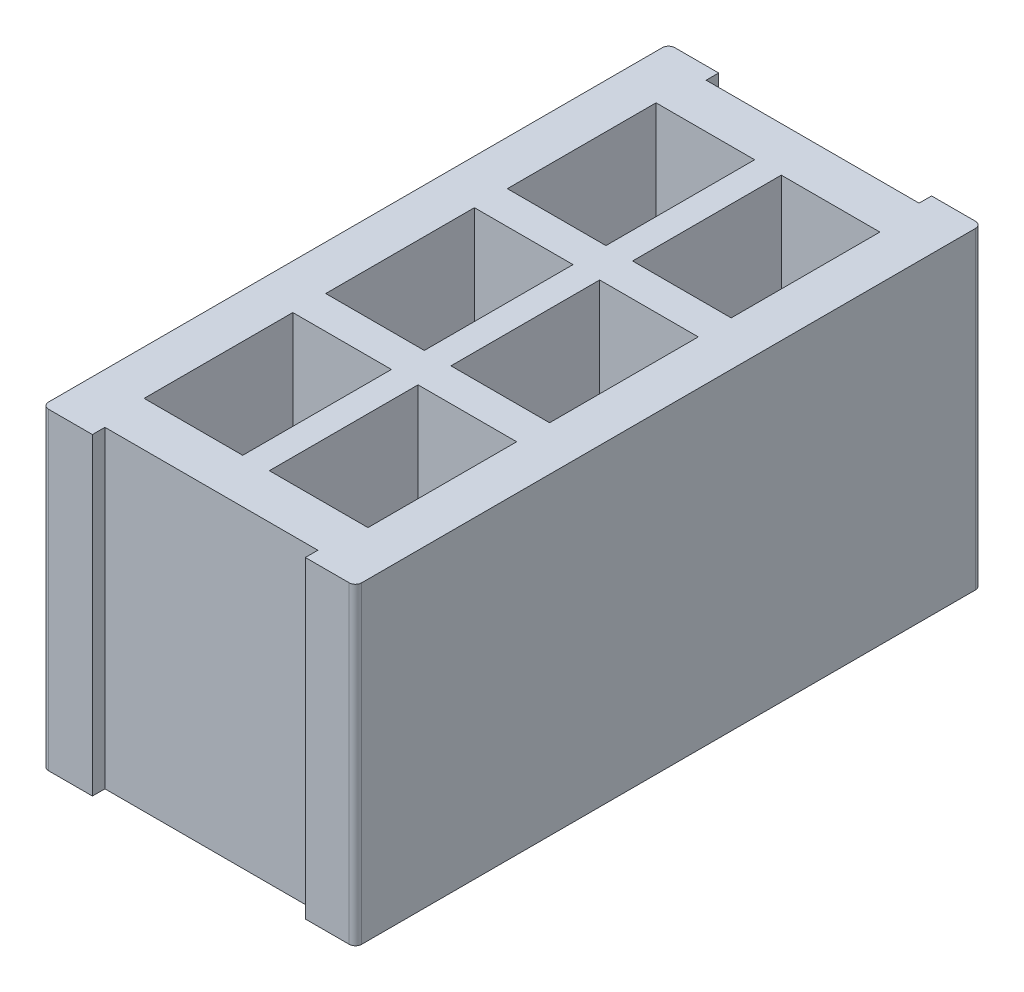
ISO-10303-21;
HEADER;
FILE_DESCRIPTION(('STEP AP214'),'2;1');
FILE_NAME('part.step','',(''),(''),'','','');
FILE_SCHEMA(('AUTOMOTIVE_DESIGN { 1 0 10303 214 1 1 1 1 }'));
ENDSEC;
DATA;
#1=APPLICATION_CONTEXT('core data for automotive mechanical design processes');
#2=APPLICATION_PROTOCOL_DEFINITION('international standard','automotive_design',2000,#1);
#3=PRODUCT_CONTEXT('',#1,'mechanical');
#4=PRODUCT('Part','Part','',(#3));
#5=PRODUCT_RELATED_PRODUCT_CATEGORY('part','',(#4));
#6=PRODUCT_DEFINITION_FORMATION('','',#4);
#7=PRODUCT_DEFINITION_CONTEXT('part definition',#1,'design');
#8=PRODUCT_DEFINITION('design','',#6,#7);
#9=PRODUCT_DEFINITION_SHAPE('','',#8);
#10=(LENGTH_UNIT() NAMED_UNIT(*) SI_UNIT(.MILLI.,.METRE.));
#11=(NAMED_UNIT(*) PLANE_ANGLE_UNIT() SI_UNIT($,.RADIAN.));
#12=(NAMED_UNIT(*) SI_UNIT($,.STERADIAN.) SOLID_ANGLE_UNIT());
#13=UNCERTAINTY_MEASURE_WITH_UNIT(LENGTH_MEASURE(1.E-05),#10,'distance_accuracy_value','');
#14=(GEOMETRIC_REPRESENTATION_CONTEXT(3) GLOBAL_UNCERTAINTY_ASSIGNED_CONTEXT((#13)) GLOBAL_UNIT_ASSIGNED_CONTEXT((#10,
#11,#12)) REPRESENTATION_CONTEXT('',''));
#15=CARTESIAN_POINT('',(0.,0.,0.));
#16=DIRECTION('',(0.,0.,1.));
#17=DIRECTION('',(1.,0.,0.));
#18=AXIS2_PLACEMENT_3D('',#15,#16,#17);
#19=CARTESIAN_POINT('',(4.,25.,-49.));
#20=DIRECTION('',(-1.,0.,0.));
#21=DIRECTION('',(0.,0.,1.));
#22=AXIS2_PLACEMENT_3D('',#19,#20,#21);
#23=PLANE('',#22);
#24=DIRECTION('',(0.,0.,-1.));
#25=VECTOR('',#24,1.);
#26=CARTESIAN_POINT('',(4.,0.,-49.));
#27=LINE('',#26,#25);
#28=CARTESIAN_POINT('',(4.,0.,-49.));
#29=VERTEX_POINT('',#28);
#30=CARTESIAN_POINT('',(4.,0.,-50.));
#31=VERTEX_POINT('',#30);
#32=EDGE_CURVE('E460',#29,#31,#27,.T.);
#33=ORIENTED_EDGE('',*,*,#32,.T.);
#34=DIRECTION('',(0.,-1.,0.));
#35=VECTOR('',#34,1.);
#36=CARTESIAN_POINT('',(4.,25.,-50.));
#37=LINE('',#36,#35);
#38=CARTESIAN_POINT('',(4.,25.,-50.));
#39=VERTEX_POINT('',#38);
#40=EDGE_CURVE('E11',#39,#31,#37,.T.);
#41=ORIENTED_EDGE('',*,*,#40,.F.);
#42=DIRECTION('',(0.,0.,-1.));
#43=VECTOR('',#42,1.);
#44=CARTESIAN_POINT('',(4.,25.,-49.));
#45=LINE('',#44,#43);
#46=CARTESIAN_POINT('',(4.,25.,-49.));
#47=VERTEX_POINT('',#46);
#48=EDGE_CURVE('E511',#47,#39,#45,.T.);
#49=ORIENTED_EDGE('',*,*,#48,.F.);
#50=DIRECTION('',(0.,-1.,0.));
#51=VECTOR('',#50,1.);
#52=CARTESIAN_POINT('',(4.,25.,-49.));
#53=LINE('',#52,#51);
#54=EDGE_CURVE('E544',#47,#29,#53,.T.);
#55=ORIENTED_EDGE('',*,*,#54,.T.);
#56=EDGE_LOOP('',(#33,#41,#49,#55));
#57=FACE_BOUND('',#56,.T.);
#58=ADVANCED_FACE('F26',(#57),#23,.F.);
#59=CARTESIAN_POINT('',(0.500000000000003,25.,-50.));
#60=DIRECTION('',(0.,0.,1.));
#61=DIRECTION('',(1.,0.,0.));
#62=AXIS2_PLACEMENT_3D('',#59,#60,#61);
#63=PLANE('',#62);
#64=DIRECTION('',(-1.,0.,0.));
#65=VECTOR('',#64,1.);
#66=CARTESIAN_POINT('',(0.500000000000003,0.,-50.));
#67=LINE('',#66,#65);
#68=CARTESIAN_POINT('',(0.500000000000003,0.,-50.));
#69=VERTEX_POINT('',#68);
#70=EDGE_CURVE('E481',#31,#69,#67,.T.);
#71=ORIENTED_EDGE('',*,*,#70,.T.);
#72=DIRECTION('',(0.,-1.,0.));
#73=VECTOR('',#72,1.);
#74=CARTESIAN_POINT('',(0.500000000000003,25.,-50.));
#75=LINE('',#74,#73);
#76=CARTESIAN_POINT('',(0.500000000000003,25.,-50.));
#77=VERTEX_POINT('',#76);
#78=EDGE_CURVE('E33',#77,#69,#75,.T.);
#79=ORIENTED_EDGE('',*,*,#78,.F.);
#80=DIRECTION('',(-1.,0.,0.));
#81=VECTOR('',#80,1.);
#82=CARTESIAN_POINT('',(0.500000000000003,25.,-50.));
#83=LINE('',#82,#81);
#84=EDGE_CURVE('E514',#39,#77,#83,.T.);
#85=ORIENTED_EDGE('',*,*,#84,.F.);
#86=ORIENTED_EDGE('',*,*,#40,.T.);
#87=EDGE_LOOP('',(#71,#79,#85,#86));
#88=FACE_BOUND('',#87,.T.);
#89=ADVANCED_FACE('F612',(#88),#63,.F.);
#90=CARTESIAN_POINT('',(0.5,25.,-49.5));
#91=DIRECTION('',(0.,-1.,0.));
#92=DIRECTION('',(0.,0.,-1.));
#93=AXIS2_PLACEMENT_3D('',#90,#91,#92);
#94=CYLINDRICAL_SURFACE('',#93,0.5);
#95=CARTESIAN_POINT('',(0.5,0.,-49.5));
#96=DIRECTION('',(0.,1.,0.));
#97=DIRECTION('',(0.,0.,1.));
#98=AXIS2_PLACEMENT_3D('',#95,#96,#97);
#99=CIRCLE('',#98,0.5);
#100=CARTESIAN_POINT('',(0.,0.,-49.5));
#101=VERTEX_POINT('',#100);
#102=EDGE_CURVE('E483',#69,#101,#99,.T.);
#103=ORIENTED_EDGE('',*,*,#102,.T.);
#104=DIRECTION('',(0.,-1.,0.));
#105=VECTOR('',#104,1.);
#106=CARTESIAN_POINT('',(0.,25.,-49.5));
#107=LINE('',#106,#105);
#108=CARTESIAN_POINT('',(0.,25.,-49.5));
#109=VERTEX_POINT('',#108);
#110=EDGE_CURVE('E583',#109,#101,#107,.T.);
#111=ORIENTED_EDGE('',*,*,#110,.F.);
#112=CARTESIAN_POINT('',(0.5,25.,-49.5));
#113=DIRECTION('',(0.,1.,0.));
#114=DIRECTION('',(0.,0.,1.));
#115=AXIS2_PLACEMENT_3D('',#112,#113,#114);
#116=CIRCLE('',#115,0.5);
#117=EDGE_CURVE('E516',#77,#109,#116,.T.);
#118=ORIENTED_EDGE('',*,*,#117,.F.);
#119=ORIENTED_EDGE('',*,*,#78,.T.);
#120=EDGE_LOOP('',(#103,#111,#118,#119));
#121=FACE_BOUND('',#120,.T.);
#122=ADVANCED_FACE('F590',(#121),#94,.T.);
#123=CARTESIAN_POINT('',(0.,25.,-49.5));
#124=DIRECTION('',(1.,0.,0.));
#125=DIRECTION('',(0.,0.,-1.));
#126=AXIS2_PLACEMENT_3D('',#123,#124,#125);
#127=PLANE('',#126);
#128=DIRECTION('',(0.,0.,1.));
#129=VECTOR('',#128,1.);
#130=CARTESIAN_POINT('',(0.,0.,-49.5));
#131=LINE('',#130,#129);
#132=CARTESIAN_POINT('',(0.,0.,-0.500000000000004));
#133=VERTEX_POINT('',#132);
#134=EDGE_CURVE('E485',#101,#133,#131,.T.);
#135=ORIENTED_EDGE('',*,*,#134,.T.);
#136=DIRECTION('',(0.,-1.,0.));
#137=VECTOR('',#136,1.);
#138=CARTESIAN_POINT('',(0.,25.,-0.500000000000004));
#139=LINE('',#138,#137);
#140=CARTESIAN_POINT('',(0.,25.,-0.500000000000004));
#141=VERTEX_POINT('',#140);
#142=EDGE_CURVE('E580',#141,#133,#139,.T.);
#143=ORIENTED_EDGE('',*,*,#142,.F.);
#144=DIRECTION('',(0.,0.,1.));
#145=VECTOR('',#144,1.);
#146=CARTESIAN_POINT('',(0.,25.,-49.5));
#147=LINE('',#146,#145);
#148=EDGE_CURVE('E518',#109,#141,#147,.T.);
#149=ORIENTED_EDGE('',*,*,#148,.F.);
#150=ORIENTED_EDGE('',*,*,#110,.T.);
#151=EDGE_LOOP('',(#135,#143,#149,#150));
#152=FACE_BOUND('',#151,.T.);
#153=ADVANCED_FACE('F600',(#152),#127,.F.);
#154=CARTESIAN_POINT('',(0.5,25.,-0.5));
#155=DIRECTION('',(0.,-1.,0.));
#156=DIRECTION('',(0.,0.,-1.));
#157=AXIS2_PLACEMENT_3D('',#154,#155,#156);
#158=CYLINDRICAL_SURFACE('',#157,0.5);
#159=CARTESIAN_POINT('',(0.5,0.,-0.5));
#160=DIRECTION('',(0.,1.,0.));
#161=DIRECTION('',(0.,0.,1.));
#162=AXIS2_PLACEMENT_3D('',#159,#160,#161);
#163=CIRCLE('',#162,0.5);
#164=CARTESIAN_POINT('',(0.500000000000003,0.,0.));
#165=VERTEX_POINT('',#164);
#166=EDGE_CURVE('E487',#133,#165,#163,.T.);
#167=ORIENTED_EDGE('',*,*,#166,.T.);
#168=DIRECTION('',(0.,-1.,0.));
#169=VECTOR('',#168,1.);
#170=CARTESIAN_POINT('',(0.500000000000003,25.,0.));
#171=LINE('',#170,#169);
#172=CARTESIAN_POINT('',(0.500000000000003,25.,0.));
#173=VERTEX_POINT('',#172);
#174=EDGE_CURVE('E577',#173,#165,#171,.T.);
#175=ORIENTED_EDGE('',*,*,#174,.F.);
#176=CARTESIAN_POINT('',(0.5,25.,-0.5));
#177=DIRECTION('',(0.,1.,0.));
#178=DIRECTION('',(0.,0.,1.));
#179=AXIS2_PLACEMENT_3D('',#176,#177,#178);
#180=CIRCLE('',#179,0.5);
#181=EDGE_CURVE('E520',#141,#173,#180,.T.);
#182=ORIENTED_EDGE('',*,*,#181,.F.);
#183=ORIENTED_EDGE('',*,*,#142,.T.);
#184=EDGE_LOOP('',(#167,#175,#182,#183));
#185=FACE_BOUND('',#184,.T.);
#186=ADVANCED_FACE('F604',(#185),#158,.T.);
#187=CARTESIAN_POINT('',(0.500000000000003,25.,0.));
#188=DIRECTION('',(0.,0.,-1.));
#189=DIRECTION('',(-1.,0.,0.));
#190=AXIS2_PLACEMENT_3D('',#187,#188,#189);
#191=PLANE('',#190);
#192=DIRECTION('',(1.,0.,0.));
#193=VECTOR('',#192,1.);
#194=CARTESIAN_POINT('',(0.500000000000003,0.,0.));
#195=LINE('',#194,#193);
#196=CARTESIAN_POINT('',(4.00000000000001,0.,0.));
#197=VERTEX_POINT('',#196);
#198=EDGE_CURVE('E489',#165,#197,#195,.T.);
#199=ORIENTED_EDGE('',*,*,#198,.T.);
#200=DIRECTION('',(0.,-1.,0.));
#201=VECTOR('',#200,1.);
#202=CARTESIAN_POINT('',(4.00000000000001,25.,0.));
#203=LINE('',#202,#201);
#204=CARTESIAN_POINT('',(4.00000000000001,25.,0.));
#205=VERTEX_POINT('',#204);
#206=EDGE_CURVE('E574',#205,#197,#203,.T.);
#207=ORIENTED_EDGE('',*,*,#206,.F.);
#208=DIRECTION('',(1.,0.,0.));
#209=VECTOR('',#208,1.);
#210=CARTESIAN_POINT('',(0.500000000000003,25.,0.));
#211=LINE('',#210,#209);
#212=EDGE_CURVE('E522',#173,#205,#211,.T.);
#213=ORIENTED_EDGE('',*,*,#212,.F.);
#214=ORIENTED_EDGE('',*,*,#174,.T.);
#215=EDGE_LOOP('',(#199,#207,#213,#214));
#216=FACE_BOUND('',#215,.T.);
#217=ADVANCED_FACE('F665',(#216),#191,.F.);
#218=CARTESIAN_POINT('',(4.00000000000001,25.,-1.));
#219=DIRECTION('',(-1.,0.,0.));
#220=DIRECTION('',(0.,0.,1.));
#221=AXIS2_PLACEMENT_3D('',#218,#219,#220);
#222=PLANE('',#221);
#223=DIRECTION('',(0.,0.,-1.));
#224=VECTOR('',#223,1.);
#225=CARTESIAN_POINT('',(4.00000000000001,0.,-1.));
#226=LINE('',#225,#224);
#227=CARTESIAN_POINT('',(4.00000000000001,0.,-1.));
#228=VERTEX_POINT('',#227);
#229=EDGE_CURVE('E491',#197,#228,#226,.T.);
#230=ORIENTED_EDGE('',*,*,#229,.T.);
#231=DIRECTION('',(0.,-1.,0.));
#232=VECTOR('',#231,1.);
#233=CARTESIAN_POINT('',(4.00000000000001,25.,-1.));
#234=LINE('',#233,#232);
#235=CARTESIAN_POINT('',(4.00000000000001,25.,-1.));
#236=VERTEX_POINT('',#235);
#237=EDGE_CURVE('E571',#236,#228,#234,.T.);
#238=ORIENTED_EDGE('',*,*,#237,.F.);
#239=DIRECTION('',(0.,0.,-1.));
#240=VECTOR('',#239,1.);
#241=CARTESIAN_POINT('',(4.00000000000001,25.,-1.));
#242=LINE('',#241,#240);
#243=EDGE_CURVE('E524',#205,#236,#242,.T.);
#244=ORIENTED_EDGE('',*,*,#243,.F.);
#245=ORIENTED_EDGE('',*,*,#206,.T.);
#246=EDGE_LOOP('',(#230,#238,#244,#245));
#247=FACE_BOUND('',#246,.T.);
#248=ADVANCED_FACE('F662',(#247),#222,.F.);
#249=CARTESIAN_POINT('',(4.00000000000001,25.,-1.));
#250=DIRECTION('',(0.,0.,-1.));
#251=DIRECTION('',(-1.,0.,0.));
#252=AXIS2_PLACEMENT_3D('',#249,#250,#251);
#253=PLANE('',#252);
#254=DIRECTION('',(1.,0.,0.));
#255=VECTOR('',#254,1.);
#256=CARTESIAN_POINT('',(4.00000000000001,0.,-1.));
#257=LINE('',#256,#255);
#258=CARTESIAN_POINT('',(21.,0.,-1.));
#259=VERTEX_POINT('',#258);
#260=EDGE_CURVE('E493',#228,#259,#257,.T.);
#261=ORIENTED_EDGE('',*,*,#260,.T.);
#262=DIRECTION('',(0.,-1.,0.));
#263=VECTOR('',#262,1.);
#264=CARTESIAN_POINT('',(21.,25.,-1.));
#265=LINE('',#264,#263);
#266=CARTESIAN_POINT('',(21.,25.,-1.));
#267=VERTEX_POINT('',#266);
#268=EDGE_CURVE('E568',#267,#259,#265,.T.);
#269=ORIENTED_EDGE('',*,*,#268,.F.);
#270=DIRECTION('',(1.,0.,0.));
#271=VECTOR('',#270,1.);
#272=CARTESIAN_POINT('',(4.00000000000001,25.,-1.));
#273=LINE('',#272,#271);
#274=EDGE_CURVE('E526',#236,#267,#273,.T.);
#275=ORIENTED_EDGE('',*,*,#274,.F.);
#276=ORIENTED_EDGE('',*,*,#237,.T.);
#277=EDGE_LOOP('',(#261,#269,#275,#276));
#278=FACE_BOUND('',#277,.T.);
#279=ADVANCED_FACE('F658',(#278),#253,.F.);
#280=CARTESIAN_POINT('',(21.,25.,-1.));
#281=DIRECTION('',(1.,0.,0.));
#282=DIRECTION('',(0.,0.,-1.));
#283=AXIS2_PLACEMENT_3D('',#280,#281,#282);
#284=PLANE('',#283);
#285=DIRECTION('',(0.,0.,1.));
#286=VECTOR('',#285,1.);
#287=CARTESIAN_POINT('',(21.,0.,-1.));
#288=LINE('',#287,#286);
#289=CARTESIAN_POINT('',(21.,0.,0.));
#290=VERTEX_POINT('',#289);
#291=EDGE_CURVE('E495',#259,#290,#288,.T.);
#292=ORIENTED_EDGE('',*,*,#291,.T.);
#293=DIRECTION('',(0.,-1.,0.));
#294=VECTOR('',#293,1.);
#295=CARTESIAN_POINT('',(21.,25.,0.));
#296=LINE('',#295,#294);
#297=CARTESIAN_POINT('',(21.,25.,0.));
#298=VERTEX_POINT('',#297);
#299=EDGE_CURVE('E565',#298,#290,#296,.T.);
#300=ORIENTED_EDGE('',*,*,#299,.F.);
#301=DIRECTION('',(0.,0.,1.));
#302=VECTOR('',#301,1.);
#303=CARTESIAN_POINT('',(21.,25.,-1.));
#304=LINE('',#303,#302);
#305=EDGE_CURVE('E528',#267,#298,#304,.T.);
#306=ORIENTED_EDGE('',*,*,#305,.F.);
#307=ORIENTED_EDGE('',*,*,#268,.T.);
#308=EDGE_LOOP('',(#292,#300,#306,#307));
#309=FACE_BOUND('',#308,.T.);
#310=ADVANCED_FACE('F654',(#309),#284,.F.);
#311=CARTESIAN_POINT('',(21.,25.,0.));
#312=DIRECTION('',(0.,0.,-1.));
#313=DIRECTION('',(-1.,0.,0.));
#314=AXIS2_PLACEMENT_3D('',#311,#312,#313);
#315=PLANE('',#314);
#316=DIRECTION('',(1.,0.,0.));
#317=VECTOR('',#316,1.);
#318=CARTESIAN_POINT('',(21.,0.,0.));
#319=LINE('',#318,#317);
#320=CARTESIAN_POINT('',(24.5,0.,0.));
#321=VERTEX_POINT('',#320);
#322=EDGE_CURVE('E497',#290,#321,#319,.T.);
#323=ORIENTED_EDGE('',*,*,#322,.T.);
#324=DIRECTION('',(0.,-1.,0.));
#325=VECTOR('',#324,1.);
#326=CARTESIAN_POINT('',(24.5,25.,0.));
#327=LINE('',#326,#325);
#328=CARTESIAN_POINT('',(24.5,25.,0.));
#329=VERTEX_POINT('',#328);
#330=EDGE_CURVE('E562',#329,#321,#327,.T.);
#331=ORIENTED_EDGE('',*,*,#330,.F.);
#332=DIRECTION('',(1.,0.,0.));
#333=VECTOR('',#332,1.);
#334=CARTESIAN_POINT('',(21.,25.,0.));
#335=LINE('',#334,#333);
#336=EDGE_CURVE('E530',#298,#329,#335,.T.);
#337=ORIENTED_EDGE('',*,*,#336,.F.);
#338=ORIENTED_EDGE('',*,*,#299,.T.);
#339=EDGE_LOOP('',(#323,#331,#337,#338));
#340=FACE_BOUND('',#339,.T.);
#341=ADVANCED_FACE('F649',(#340),#315,.F.);
#342=CARTESIAN_POINT('',(24.5,25.,-0.5));
#343=DIRECTION('',(0.,-1.,0.));
#344=DIRECTION('',(0.,0.,-1.));
#345=AXIS2_PLACEMENT_3D('',#342,#343,#344);
#346=CYLINDRICAL_SURFACE('',#345,0.5);
#347=CARTESIAN_POINT('',(24.5,0.,-0.5));
#348=DIRECTION('',(0.,1.,0.));
#349=DIRECTION('',(0.,0.,1.));
#350=AXIS2_PLACEMENT_3D('',#347,#348,#349);
#351=CIRCLE('',#350,0.5);
#352=CARTESIAN_POINT('',(25.,0.,-0.500000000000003));
#353=VERTEX_POINT('',#352);
#354=EDGE_CURVE('E499',#321,#353,#351,.T.);
#355=ORIENTED_EDGE('',*,*,#354,.T.);
#356=DIRECTION('',(0.,-1.,0.));
#357=VECTOR('',#356,1.);
#358=CARTESIAN_POINT('',(25.,25.,-0.500000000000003));
#359=LINE('',#358,#357);
#360=CARTESIAN_POINT('',(25.,25.,-0.500000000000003));
#361=VERTEX_POINT('',#360);
#362=EDGE_CURVE('E559',#361,#353,#359,.T.);
#363=ORIENTED_EDGE('',*,*,#362,.F.);
#364=CARTESIAN_POINT('',(24.5,25.,-0.5));
#365=DIRECTION('',(0.,1.,0.));
#366=DIRECTION('',(0.,0.,1.));
#367=AXIS2_PLACEMENT_3D('',#364,#365,#366);
#368=CIRCLE('',#367,0.5);
#369=EDGE_CURVE('E532',#329,#361,#368,.T.);
#370=ORIENTED_EDGE('',*,*,#369,.F.);
#371=ORIENTED_EDGE('',*,*,#330,.T.);
#372=EDGE_LOOP('',(#355,#363,#370,#371));
#373=FACE_BOUND('',#372,.T.);
#374=ADVANCED_FACE('F643',(#373),#346,.T.);
#375=CARTESIAN_POINT('',(25.,25.,-49.5));
#376=DIRECTION('',(-1.,0.,0.));
#377=DIRECTION('',(0.,0.,1.));
#378=AXIS2_PLACEMENT_3D('',#375,#376,#377);
#379=PLANE('',#378);
#380=DIRECTION('',(0.,0.,-1.));
#381=VECTOR('',#380,1.);
#382=CARTESIAN_POINT('',(25.,0.,-49.5));
#383=LINE('',#382,#381);
#384=CARTESIAN_POINT('',(25.,0.,-49.5));
#385=VERTEX_POINT('',#384);
#386=EDGE_CURVE('E501',#353,#385,#383,.T.);
#387=ORIENTED_EDGE('',*,*,#386,.T.);
#388=DIRECTION('',(0.,-1.,0.));
#389=VECTOR('',#388,1.);
#390=CARTESIAN_POINT('',(25.,25.,-49.5));
#391=LINE('',#390,#389);
#392=CARTESIAN_POINT('',(25.,25.,-49.5));
#393=VERTEX_POINT('',#392);
#394=EDGE_CURVE('E556',#393,#385,#391,.T.);
#395=ORIENTED_EDGE('',*,*,#394,.F.);
#396=DIRECTION('',(0.,0.,-1.));
#397=VECTOR('',#396,1.);
#398=CARTESIAN_POINT('',(25.,25.,-49.5));
#399=LINE('',#398,#397);
#400=EDGE_CURVE('E534',#361,#393,#399,.T.);
#401=ORIENTED_EDGE('',*,*,#400,.F.);
#402=ORIENTED_EDGE('',*,*,#362,.T.);
#403=EDGE_LOOP('',(#387,#395,#401,#402));
#404=FACE_BOUND('',#403,.T.);
#405=ADVANCED_FACE('F639',(#404),#379,.F.);
#406=CARTESIAN_POINT('',(24.5,25.,-49.5));
#407=DIRECTION('',(0.,-1.,0.));
#408=DIRECTION('',(0.,0.,-1.));
#409=AXIS2_PLACEMENT_3D('',#406,#407,#408);
#410=CYLINDRICAL_SURFACE('',#409,0.5);
#411=CARTESIAN_POINT('',(24.5,0.,-49.5));
#412=DIRECTION('',(0.,1.,0.));
#413=DIRECTION('',(0.,0.,-1.));
#414=AXIS2_PLACEMENT_3D('',#411,#412,#413);
#415=CIRCLE('',#414,0.5);
#416=CARTESIAN_POINT('',(24.5,0.,-50.));
#417=VERTEX_POINT('',#416);
#418=EDGE_CURVE('E503',#385,#417,#415,.T.);
#419=ORIENTED_EDGE('',*,*,#418,.T.);
#420=DIRECTION('',(0.,-1.,0.));
#421=VECTOR('',#420,1.);
#422=CARTESIAN_POINT('',(24.5,25.,-50.));
#423=LINE('',#422,#421);
#424=CARTESIAN_POINT('',(24.5,25.,-50.));
#425=VERTEX_POINT('',#424);
#426=EDGE_CURVE('E553',#425,#417,#423,.T.);
#427=ORIENTED_EDGE('',*,*,#426,.F.);
#428=CARTESIAN_POINT('',(24.5,25.,-49.5));
#429=DIRECTION('',(0.,1.,0.));
#430=DIRECTION('',(0.,0.,-1.));
#431=AXIS2_PLACEMENT_3D('',#428,#429,#430);
#432=CIRCLE('',#431,0.5);
#433=EDGE_CURVE('E536',#393,#425,#432,.T.);
#434=ORIENTED_EDGE('',*,*,#433,.F.);
#435=ORIENTED_EDGE('',*,*,#394,.T.);
#436=EDGE_LOOP('',(#419,#427,#434,#435));
#437=FACE_BOUND('',#436,.T.);
#438=ADVANCED_FACE('F634',(#437),#410,.T.);
#439=CARTESIAN_POINT('',(21.,25.,-50.));
#440=DIRECTION('',(0.,0.,1.));
#441=DIRECTION('',(1.,0.,0.));
#442=AXIS2_PLACEMENT_3D('',#439,#440,#441);
#443=PLANE('',#442);
#444=DIRECTION('',(-1.,0.,0.));
#445=VECTOR('',#444,1.);
#446=CARTESIAN_POINT('',(21.,0.,-50.));
#447=LINE('',#446,#445);
#448=CARTESIAN_POINT('',(21.,0.,-50.));
#449=VERTEX_POINT('',#448);
#450=EDGE_CURVE('E505',#417,#449,#447,.T.);
#451=ORIENTED_EDGE('',*,*,#450,.T.);
#452=DIRECTION('',(0.,-1.,0.));
#453=VECTOR('',#452,1.);
#454=CARTESIAN_POINT('',(21.,25.,-50.));
#455=LINE('',#454,#453);
#456=CARTESIAN_POINT('',(21.,25.,-50.));
#457=VERTEX_POINT('',#456);
#458=EDGE_CURVE('E550',#457,#449,#455,.T.);
#459=ORIENTED_EDGE('',*,*,#458,.F.);
#460=DIRECTION('',(-1.,0.,0.));
#461=VECTOR('',#460,1.);
#462=CARTESIAN_POINT('',(21.,25.,-50.));
#463=LINE('',#462,#461);
#464=EDGE_CURVE('E538',#425,#457,#463,.T.);
#465=ORIENTED_EDGE('',*,*,#464,.F.);
#466=ORIENTED_EDGE('',*,*,#426,.T.);
#467=EDGE_LOOP('',(#451,#459,#465,#466));
#468=FACE_BOUND('',#467,.T.);
#469=ADVANCED_FACE('F628',(#468),#443,.F.);
#470=CARTESIAN_POINT('',(21.,25.,-49.));
#471=DIRECTION('',(1.,0.,0.));
#472=DIRECTION('',(0.,0.,-1.));
#473=AXIS2_PLACEMENT_3D('',#470,#471,#472);
#474=PLANE('',#473);
#475=DIRECTION('',(0.,0.,1.));
#476=VECTOR('',#475,1.);
#477=CARTESIAN_POINT('',(21.,0.,-49.));
#478=LINE('',#477,#476);
#479=CARTESIAN_POINT('',(21.,0.,-49.));
#480=VERTEX_POINT('',#479);
#481=EDGE_CURVE('E507',#449,#480,#478,.T.);
#482=ORIENTED_EDGE('',*,*,#481,.T.);
#483=DIRECTION('',(0.,-1.,0.));
#484=VECTOR('',#483,1.);
#485=CARTESIAN_POINT('',(21.,25.,-49.));
#486=LINE('',#485,#484);
#487=CARTESIAN_POINT('',(21.,25.,-49.));
#488=VERTEX_POINT('',#487);
#489=EDGE_CURVE('E547',#488,#480,#486,.T.);
#490=ORIENTED_EDGE('',*,*,#489,.F.);
#491=DIRECTION('',(0.,0.,1.));
#492=VECTOR('',#491,1.);
#493=CARTESIAN_POINT('',(21.,25.,-49.));
#494=LINE('',#493,#492);
#495=EDGE_CURVE('E540',#457,#488,#494,.T.);
#496=ORIENTED_EDGE('',*,*,#495,.F.);
#497=ORIENTED_EDGE('',*,*,#458,.T.);
#498=EDGE_LOOP('',(#482,#490,#496,#497));
#499=FACE_BOUND('',#498,.T.);
#500=ADVANCED_FACE('F624',(#499),#474,.F.);
#501=CARTESIAN_POINT('',(4.,25.,-49.));
#502=DIRECTION('',(0.,0.,1.));
#503=DIRECTION('',(1.,0.,0.));
#504=AXIS2_PLACEMENT_3D('',#501,#502,#503);
#505=PLANE('',#504);
#506=DIRECTION('',(-1.,0.,0.));
#507=VECTOR('',#506,1.);
#508=CARTESIAN_POINT('',(4.,0.,-49.));
#509=LINE('',#508,#507);
#510=EDGE_CURVE('E509',#480,#29,#509,.T.);
#511=ORIENTED_EDGE('',*,*,#510,.T.);
#512=ORIENTED_EDGE('',*,*,#54,.F.);
#513=DIRECTION('',(-1.,0.,0.));
#514=VECTOR('',#513,1.);
#515=CARTESIAN_POINT('',(4.,25.,-49.));
#516=LINE('',#515,#514);
#517=EDGE_CURVE('E542',#488,#47,#516,.T.);
#518=ORIENTED_EDGE('',*,*,#517,.F.);
#519=ORIENTED_EDGE('',*,*,#489,.T.);
#520=EDGE_LOOP('',(#511,#512,#518,#519));
#521=FACE_BOUND('',#520,.T.);
#522=ADVANCED_FACE('F619',(#521),#505,.F.);
#523=CARTESIAN_POINT('',(0.5,25.,-49.5));
#524=DIRECTION('',(0.,1.,0.));
#525=DIRECTION('',(0.,0.,1.));
#526=AXIS2_PLACEMENT_3D('',#523,#524,#525);
#527=PLANE('',#526);
#528=DIRECTION('',(1.,0.,0.));
#529=VECTOR('',#528,1.);
#530=CARTESIAN_POINT('',(21.,25.,-45.4363766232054));
#531=LINE('',#530,#529);
#532=CARTESIAN_POINT('',(13.5636233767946,25.,-45.4363766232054));
#533=VERTEX_POINT('',#532);
#534=CARTESIAN_POINT('',(21.4363766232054,25.,-45.4363766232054));
#535=VERTEX_POINT('',#534);
#536=EDGE_CURVE('E302',#533,#535,#531,.T.);
#537=ORIENTED_EDGE('',*,*,#536,.T.);
#538=DIRECTION('',(0.,0.,1.));
#539=VECTOR('',#538,1.);
#540=CARTESIAN_POINT('',(21.4363766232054,25.,-45.));
#541=LINE('',#540,#539);
#542=CARTESIAN_POINT('',(21.4363766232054,25.,-33.5636233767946));
#543=VERTEX_POINT('',#542);
#544=EDGE_CURVE('E314',#535,#543,#541,.T.);
#545=ORIENTED_EDGE('',*,*,#544,.T.);
#546=DIRECTION('',(-1.,0.,0.));
#547=VECTOR('',#546,1.);
#548=CARTESIAN_POINT('',(21.,25.,-33.5636233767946));
#549=LINE('',#548,#547);
#550=CARTESIAN_POINT('',(13.5636233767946,25.,-33.5636233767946));
#551=VERTEX_POINT('',#550);
#552=EDGE_CURVE('E40',#543,#551,#549,.T.);
#553=ORIENTED_EDGE('',*,*,#552,.T.);
#554=DIRECTION('',(0.,0.,-1.));
#555=VECTOR('',#554,1.);
#556=CARTESIAN_POINT('',(13.5636233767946,25.,-45.));
#557=LINE('',#556,#555);
#558=EDGE_CURVE('E309',#551,#533,#557,.T.);
#559=ORIENTED_EDGE('',*,*,#558,.T.);
#560=EDGE_LOOP('',(#537,#545,#553,#559));
#561=FACE_BOUND('',#560,.T.);
#562=DIRECTION('',(1.,0.,0.));
#563=VECTOR('',#562,1.);
#564=CARTESIAN_POINT('',(21.,25.,-30.9363766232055));
#565=LINE('',#564,#563);
#566=CARTESIAN_POINT('',(13.5636233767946,25.,-30.9363766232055));
#567=VERTEX_POINT('',#566);
#568=CARTESIAN_POINT('',(21.4363766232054,25.,-30.9363766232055));
#569=VERTEX_POINT('',#568);
#570=EDGE_CURVE('E329',#567,#569,#565,.T.);
#571=ORIENTED_EDGE('',*,*,#570,.T.);
#572=DIRECTION('',(0.,0.,1.));
#573=VECTOR('',#572,1.);
#574=CARTESIAN_POINT('',(21.4363766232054,25.,-30.5));
#575=LINE('',#574,#573);
#576=CARTESIAN_POINT('',(21.4363766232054,25.,-19.0636233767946));
#577=VERTEX_POINT('',#576);
#578=EDGE_CURVE('E343',#569,#577,#575,.T.);
#579=ORIENTED_EDGE('',*,*,#578,.T.);
#580=DIRECTION('',(-1.,0.,0.));
#581=VECTOR('',#580,1.);
#582=CARTESIAN_POINT('',(21.,25.,-19.0636233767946));
#583=LINE('',#582,#581);
#584=CARTESIAN_POINT('',(13.5636233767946,25.,-19.0636233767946));
#585=VERTEX_POINT('',#584);
#586=EDGE_CURVE('E346',#577,#585,#583,.T.);
#587=ORIENTED_EDGE('',*,*,#586,.T.);
#588=DIRECTION('',(0.,0.,-1.));
#589=VECTOR('',#588,1.);
#590=CARTESIAN_POINT('',(13.5636233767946,25.,-30.5));
#591=LINE('',#590,#589);
#592=EDGE_CURVE('E338',#585,#567,#591,.T.);
#593=ORIENTED_EDGE('',*,*,#592,.T.);
#594=EDGE_LOOP('',(#571,#579,#587,#593));
#595=FACE_BOUND('',#594,.T.);
#596=DIRECTION('',(1.,0.,0.));
#597=VECTOR('',#596,1.);
#598=CARTESIAN_POINT('',(21.,25.,-16.4363766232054));
#599=LINE('',#598,#597);
#600=CARTESIAN_POINT('',(13.5636233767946,25.,-16.4363766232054));
#601=VERTEX_POINT('',#600);
#602=CARTESIAN_POINT('',(21.4363766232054,25.,-16.4363766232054));
#603=VERTEX_POINT('',#602);
#604=EDGE_CURVE('E361',#601,#603,#599,.T.);
#605=ORIENTED_EDGE('',*,*,#604,.T.);
#606=DIRECTION('',(0.,0.,1.));
#607=VECTOR('',#606,1.);
#608=CARTESIAN_POINT('',(21.4363766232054,25.,-16.));
#609=LINE('',#608,#607);
#610=CARTESIAN_POINT('',(21.4363766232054,25.,-4.56362337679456));
#611=VERTEX_POINT('',#610);
#612=EDGE_CURVE('E375',#603,#611,#609,.T.);
#613=ORIENTED_EDGE('',*,*,#612,.T.);
#614=DIRECTION('',(-1.,0.,0.));
#615=VECTOR('',#614,1.);
#616=CARTESIAN_POINT('',(21.,25.,-4.56362337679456));
#617=LINE('',#616,#615);
#618=CARTESIAN_POINT('',(13.5636233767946,25.,-4.56362337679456));
#619=VERTEX_POINT('',#618);
#620=EDGE_CURVE('E378',#611,#619,#617,.T.);
#621=ORIENTED_EDGE('',*,*,#620,.T.);
#622=DIRECTION('',(0.,0.,-1.));
#623=VECTOR('',#622,1.);
#624=CARTESIAN_POINT('',(13.5636233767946,25.,-16.));
#625=LINE('',#624,#623);
#626=EDGE_CURVE('E370',#619,#601,#625,.T.);
#627=ORIENTED_EDGE('',*,*,#626,.T.);
#628=EDGE_LOOP('',(#605,#613,#621,#627));
#629=FACE_BOUND('',#628,.T.);
#630=DIRECTION('',(0.,0.,-1.));
#631=VECTOR('',#630,1.);
#632=CARTESIAN_POINT('',(3.56362337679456,25.,-16.));
#633=LINE('',#632,#631);
#634=CARTESIAN_POINT('',(3.56362337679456,25.,-4.56362337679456));
#635=VERTEX_POINT('',#634);
#636=CARTESIAN_POINT('',(3.56362337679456,25.,-16.4363766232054));
#637=VERTEX_POINT('',#636);
#638=EDGE_CURVE('E393',#635,#637,#633,.T.);
#639=ORIENTED_EDGE('',*,*,#638,.T.);
#640=DIRECTION('',(1.,0.,0.));
#641=VECTOR('',#640,1.);
#642=CARTESIAN_POINT('',(4.,25.,-16.4363766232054));
#643=LINE('',#642,#641);
#644=CARTESIAN_POINT('',(11.4363766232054,25.,-16.4363766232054));
#645=VERTEX_POINT('',#644);
#646=EDGE_CURVE('E407',#637,#645,#643,.T.);
#647=ORIENTED_EDGE('',*,*,#646,.T.);
#648=DIRECTION('',(0.,0.,1.));
#649=VECTOR('',#648,1.);
#650=CARTESIAN_POINT('',(11.4363766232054,25.,-16.));
#651=LINE('',#650,#649);
#652=CARTESIAN_POINT('',(11.4363766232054,25.,-4.56362337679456));
#653=VERTEX_POINT('',#652);
#654=EDGE_CURVE('E410',#645,#653,#651,.T.);
#655=ORIENTED_EDGE('',*,*,#654,.T.);
#656=DIRECTION('',(-1.,0.,0.));
#657=VECTOR('',#656,1.);
#658=CARTESIAN_POINT('',(4.,25.,-4.56362337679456));
#659=LINE('',#658,#657);
#660=EDGE_CURVE('E402',#653,#635,#659,.T.);
#661=ORIENTED_EDGE('',*,*,#660,.T.);
#662=EDGE_LOOP('',(#639,#647,#655,#661));
#663=FACE_BOUND('',#662,.T.);
#664=DIRECTION('',(0.,0.,-1.));
#665=VECTOR('',#664,1.);
#666=CARTESIAN_POINT('',(3.56362337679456,25.,-30.5));
#667=LINE('',#666,#665);
#668=CARTESIAN_POINT('',(3.56362337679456,25.,-19.0636233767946));
#669=VERTEX_POINT('',#668);
#670=CARTESIAN_POINT('',(3.56362337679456,25.,-30.9363766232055));
#671=VERTEX_POINT('',#670);
#672=EDGE_CURVE('E425',#669,#671,#667,.T.);
#673=ORIENTED_EDGE('',*,*,#672,.T.);
#674=DIRECTION('',(1.,0.,0.));
#675=VECTOR('',#674,1.);
#676=CARTESIAN_POINT('',(4.,25.,-30.9363766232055));
#677=LINE('',#676,#675);
#678=CARTESIAN_POINT('',(11.4363766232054,25.,-30.9363766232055));
#679=VERTEX_POINT('',#678);
#680=EDGE_CURVE('E439',#671,#679,#677,.T.);
#681=ORIENTED_EDGE('',*,*,#680,.T.);
#682=DIRECTION('',(0.,0.,1.));
#683=VECTOR('',#682,1.);
#684=CARTESIAN_POINT('',(11.4363766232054,25.,-30.5));
#685=LINE('',#684,#683);
#686=CARTESIAN_POINT('',(11.4363766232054,25.,-19.0636233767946));
#687=VERTEX_POINT('',#686);
#688=EDGE_CURVE('E442',#679,#687,#685,.T.);
#689=ORIENTED_EDGE('',*,*,#688,.T.);
#690=DIRECTION('',(-1.,0.,0.));
#691=VECTOR('',#690,1.);
#692=CARTESIAN_POINT('',(4.,25.,-19.0636233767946));
#693=LINE('',#692,#691);
#694=EDGE_CURVE('E434',#687,#669,#693,.T.);
#695=ORIENTED_EDGE('',*,*,#694,.T.);
#696=EDGE_LOOP('',(#673,#681,#689,#695));
#697=FACE_BOUND('',#696,.T.);
#698=DIRECTION('',(0.,0.,-1.));
#699=VECTOR('',#698,1.);
#700=CARTESIAN_POINT('',(3.56362337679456,25.,-45.));
#701=LINE('',#700,#699);
#702=CARTESIAN_POINT('',(3.56362337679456,25.,-33.5636233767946));
#703=VERTEX_POINT('',#702);
#704=CARTESIAN_POINT('',(3.56362337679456,25.,-45.4363766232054));
#705=VERTEX_POINT('',#704);
#706=EDGE_CURVE('E457',#703,#705,#701,.T.);
#707=ORIENTED_EDGE('',*,*,#706,.T.);
#708=DIRECTION('',(1.,0.,0.));
#709=VECTOR('',#708,1.);
#710=CARTESIAN_POINT('',(4.,25.,-45.4363766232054));
#711=LINE('',#710,#709);
#712=CARTESIAN_POINT('',(11.4363766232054,25.,-45.4363766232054));
#713=VERTEX_POINT('',#712);
#714=EDGE_CURVE('E471',#705,#713,#711,.T.);
#715=ORIENTED_EDGE('',*,*,#714,.T.);
#716=DIRECTION('',(0.,0.,1.));
#717=VECTOR('',#716,1.);
#718=CARTESIAN_POINT('',(11.4363766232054,25.,-45.));
#719=LINE('',#718,#717);
#720=CARTESIAN_POINT('',(11.4363766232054,25.,-33.5636233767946));
#721=VERTEX_POINT('',#720);
#722=EDGE_CURVE('E474',#713,#721,#719,.T.);
#723=ORIENTED_EDGE('',*,*,#722,.T.);
#724=DIRECTION('',(-1.,0.,0.));
#725=VECTOR('',#724,1.);
#726=CARTESIAN_POINT('',(4.,25.,-33.5636233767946));
#727=LINE('',#726,#725);
#728=EDGE_CURVE('E466',#721,#703,#727,.T.);
#729=ORIENTED_EDGE('',*,*,#728,.T.);
#730=EDGE_LOOP('',(#707,#715,#723,#729));
#731=FACE_BOUND('',#730,.T.);
#732=ORIENTED_EDGE('',*,*,#48,.T.);
#733=ORIENTED_EDGE('',*,*,#84,.T.);
#734=ORIENTED_EDGE('',*,*,#117,.T.);
#735=ORIENTED_EDGE('',*,*,#148,.T.);
#736=ORIENTED_EDGE('',*,*,#181,.T.);
#737=ORIENTED_EDGE('',*,*,#212,.T.);
#738=ORIENTED_EDGE('',*,*,#243,.T.);
#739=ORIENTED_EDGE('',*,*,#274,.T.);
#740=ORIENTED_EDGE('',*,*,#305,.T.);
#741=ORIENTED_EDGE('',*,*,#336,.T.);
#742=ORIENTED_EDGE('',*,*,#369,.T.);
#743=ORIENTED_EDGE('',*,*,#400,.T.);
#744=ORIENTED_EDGE('',*,*,#433,.T.);
#745=ORIENTED_EDGE('',*,*,#464,.T.);
#746=ORIENTED_EDGE('',*,*,#495,.T.);
#747=ORIENTED_EDGE('',*,*,#517,.T.);
#748=EDGE_LOOP('',(#732,#733,#734,#735,#736,#737,#738,#739,#740,#741,#742,#743,#744,#745,#746,#747));
#749=FACE_BOUND('',#748,.T.);
#750=ADVANCED_FACE('F608',(#561,#595,#629,#663,#697,#731,#749),#527,.T.);
#751=CARTESIAN_POINT('',(0.5,0.,-49.5));
#752=DIRECTION('',(0.,1.,0.));
#753=DIRECTION('',(0.,0.,1.));
#754=AXIS2_PLACEMENT_3D('',#751,#752,#753);
#755=PLANE('',#754);
#756=DIRECTION('',(0.,0.,1.));
#757=VECTOR('',#756,1.);
#758=CARTESIAN_POINT('',(21.,0.,-45.));
#759=LINE('',#758,#757);
#760=CARTESIAN_POINT('',(21.,0.,-45.));
#761=VERTEX_POINT('',#760);
#762=CARTESIAN_POINT('',(21.,0.,-34.));
#763=VERTEX_POINT('',#762);
#764=EDGE_CURVE('E293',#761,#763,#759,.T.);
#765=ORIENTED_EDGE('',*,*,#764,.F.);
#766=DIRECTION('',(1.,0.,0.));
#767=VECTOR('',#766,1.);
#768=CARTESIAN_POINT('',(21.,0.,-45.));
#769=LINE('',#768,#767);
#770=CARTESIAN_POINT('',(14.,0.,-45.));
#771=VERTEX_POINT('',#770);
#772=EDGE_CURVE('E48',#771,#761,#769,.T.);
#773=ORIENTED_EDGE('',*,*,#772,.F.);
#774=DIRECTION('',(0.,0.,-1.));
#775=VECTOR('',#774,1.);
#776=CARTESIAN_POINT('',(14.,0.,-45.));
#777=LINE('',#776,#775);
#778=CARTESIAN_POINT('',(14.,0.,-34.));
#779=VERTEX_POINT('',#778);
#780=EDGE_CURVE('E300',#779,#771,#777,.T.);
#781=ORIENTED_EDGE('',*,*,#780,.F.);
#782=DIRECTION('',(-1.,0.,0.));
#783=VECTOR('',#782,1.);
#784=CARTESIAN_POINT('',(21.,0.,-34.));
#785=LINE('',#784,#783);
#786=EDGE_CURVE('E284',#763,#779,#785,.T.);
#787=ORIENTED_EDGE('',*,*,#786,.F.);
#788=EDGE_LOOP('',(#765,#773,#781,#787));
#789=FACE_BOUND('',#788,.T.);
#790=DIRECTION('',(0.,0.,1.));
#791=VECTOR('',#790,1.);
#792=CARTESIAN_POINT('',(21.,0.,-30.5));
#793=LINE('',#792,#791);
#794=CARTESIAN_POINT('',(21.,0.,-30.5));
#795=VERTEX_POINT('',#794);
#796=CARTESIAN_POINT('',(21.,0.,-19.5));
#797=VERTEX_POINT('',#796);
#798=EDGE_CURVE('E320',#795,#797,#793,.T.);
#799=ORIENTED_EDGE('',*,*,#798,.F.);
#800=DIRECTION('',(1.,0.,0.));
#801=VECTOR('',#800,1.);
#802=CARTESIAN_POINT('',(21.,0.,-30.5));
#803=LINE('',#802,#801);
#804=CARTESIAN_POINT('',(14.,0.,-30.5));
#805=VERTEX_POINT('',#804);
#806=EDGE_CURVE('E308',#805,#795,#803,.T.);
#807=ORIENTED_EDGE('',*,*,#806,.F.);
#808=DIRECTION('',(0.,0.,-1.));
#809=VECTOR('',#808,1.);
#810=CARTESIAN_POINT('',(14.,0.,-30.5));
#811=LINE('',#810,#809);
#812=CARTESIAN_POINT('',(14.,0.,-19.5));
#813=VERTEX_POINT('',#812);
#814=EDGE_CURVE('E326',#813,#805,#811,.T.);
#815=ORIENTED_EDGE('',*,*,#814,.F.);
#816=DIRECTION('',(-1.,0.,0.));
#817=VECTOR('',#816,1.);
#818=CARTESIAN_POINT('',(21.,0.,-19.5));
#819=LINE('',#818,#817);
#820=EDGE_CURVE('E323',#797,#813,#819,.T.);
#821=ORIENTED_EDGE('',*,*,#820,.F.);
#822=EDGE_LOOP('',(#799,#807,#815,#821));
#823=FACE_BOUND('',#822,.T.);
#824=DIRECTION('',(0.,0.,1.));
#825=VECTOR('',#824,1.);
#826=CARTESIAN_POINT('',(21.,0.,-16.));
#827=LINE('',#826,#825);
#828=CARTESIAN_POINT('',(21.,0.,-16.));
#829=VERTEX_POINT('',#828);
#830=CARTESIAN_POINT('',(21.,0.,-5.));
#831=VERTEX_POINT('',#830);
#832=EDGE_CURVE('E352',#829,#831,#827,.T.);
#833=ORIENTED_EDGE('',*,*,#832,.F.);
#834=DIRECTION('',(1.,0.,0.));
#835=VECTOR('',#834,1.);
#836=CARTESIAN_POINT('',(21.,0.,-16.));
#837=LINE('',#836,#835);
#838=CARTESIAN_POINT('',(14.,0.,-16.));
#839=VERTEX_POINT('',#838);
#840=EDGE_CURVE('E332',#839,#829,#837,.T.);
#841=ORIENTED_EDGE('',*,*,#840,.F.);
#842=DIRECTION('',(0.,0.,-1.));
#843=VECTOR('',#842,1.);
#844=CARTESIAN_POINT('',(14.,0.,-16.));
#845=LINE('',#844,#843);
#846=CARTESIAN_POINT('',(14.,0.,-5.));
#847=VERTEX_POINT('',#846);
#848=EDGE_CURVE('E358',#847,#839,#845,.T.);
#849=ORIENTED_EDGE('',*,*,#848,.F.);
#850=DIRECTION('',(-1.,0.,0.));
#851=VECTOR('',#850,1.);
#852=CARTESIAN_POINT('',(21.,0.,-5.));
#853=LINE('',#852,#851);
#854=EDGE_CURVE('E355',#831,#847,#853,.T.);
#855=ORIENTED_EDGE('',*,*,#854,.F.);
#856=EDGE_LOOP('',(#833,#841,#849,#855));
#857=FACE_BOUND('',#856,.T.);
#858=DIRECTION('',(1.,0.,0.));
#859=VECTOR('',#858,1.);
#860=CARTESIAN_POINT('',(4.,0.,-16.));
#861=LINE('',#860,#859);
#862=CARTESIAN_POINT('',(4.,0.,-16.));
#863=VERTEX_POINT('',#862);
#864=CARTESIAN_POINT('',(11.,0.,-16.));
#865=VERTEX_POINT('',#864);
#866=EDGE_CURVE('E384',#863,#865,#861,.T.);
#867=ORIENTED_EDGE('',*,*,#866,.F.);
#868=DIRECTION('',(0.,0.,-1.));
#869=VECTOR('',#868,1.);
#870=CARTESIAN_POINT('',(4.,0.,-16.));
#871=LINE('',#870,#869);
#872=CARTESIAN_POINT('',(4.,0.,-5.));
#873=VERTEX_POINT('',#872);
#874=EDGE_CURVE('E364',#873,#863,#871,.T.);
#875=ORIENTED_EDGE('',*,*,#874,.F.);
#876=DIRECTION('',(-1.,0.,0.));
#877=VECTOR('',#876,1.);
#878=CARTESIAN_POINT('',(4.,0.,-5.));
#879=LINE('',#878,#877);
#880=CARTESIAN_POINT('',(11.,0.,-5.));
#881=VERTEX_POINT('',#880);
#882=EDGE_CURVE('E390',#881,#873,#879,.T.);
#883=ORIENTED_EDGE('',*,*,#882,.F.);
#884=DIRECTION('',(0.,0.,1.));
#885=VECTOR('',#884,1.);
#886=CARTESIAN_POINT('',(11.,0.,-16.));
#887=LINE('',#886,#885);
#888=EDGE_CURVE('E387',#865,#881,#887,.T.);
#889=ORIENTED_EDGE('',*,*,#888,.F.);
#890=EDGE_LOOP('',(#867,#875,#883,#889));
#891=FACE_BOUND('',#890,.T.);
#892=DIRECTION('',(1.,0.,0.));
#893=VECTOR('',#892,1.);
#894=CARTESIAN_POINT('',(4.,0.,-30.5));
#895=LINE('',#894,#893);
#896=CARTESIAN_POINT('',(4.,0.,-30.5));
#897=VERTEX_POINT('',#896);
#898=CARTESIAN_POINT('',(11.,0.,-30.5));
#899=VERTEX_POINT('',#898);
#900=EDGE_CURVE('E416',#897,#899,#895,.T.);
#901=ORIENTED_EDGE('',*,*,#900,.F.);
#902=DIRECTION('',(0.,0.,-1.));
#903=VECTOR('',#902,1.);
#904=CARTESIAN_POINT('',(4.,0.,-30.5));
#905=LINE('',#904,#903);
#906=CARTESIAN_POINT('',(4.,0.,-19.5));
#907=VERTEX_POINT('',#906);
#908=EDGE_CURVE('E396',#907,#897,#905,.T.);
#909=ORIENTED_EDGE('',*,*,#908,.F.);
#910=DIRECTION('',(-1.,0.,0.));
#911=VECTOR('',#910,1.);
#912=CARTESIAN_POINT('',(4.,0.,-19.5));
#913=LINE('',#912,#911);
#914=CARTESIAN_POINT('',(11.,0.,-19.5));
#915=VERTEX_POINT('',#914);
#916=EDGE_CURVE('E422',#915,#907,#913,.T.);
#917=ORIENTED_EDGE('',*,*,#916,.F.);
#918=DIRECTION('',(0.,0.,1.));
#919=VECTOR('',#918,1.);
#920=CARTESIAN_POINT('',(11.,0.,-30.5));
#921=LINE('',#920,#919);
#922=EDGE_CURVE('E419',#899,#915,#921,.T.);
#923=ORIENTED_EDGE('',*,*,#922,.F.);
#924=EDGE_LOOP('',(#901,#909,#917,#923));
#925=FACE_BOUND('',#924,.T.);
#926=DIRECTION('',(1.,0.,0.));
#927=VECTOR('',#926,1.);
#928=CARTESIAN_POINT('',(4.,0.,-45.));
#929=LINE('',#928,#927);
#930=CARTESIAN_POINT('',(4.,0.,-45.));
#931=VERTEX_POINT('',#930);
#932=CARTESIAN_POINT('',(11.,0.,-45.));
#933=VERTEX_POINT('',#932);
#934=EDGE_CURVE('E448',#931,#933,#929,.T.);
#935=ORIENTED_EDGE('',*,*,#934,.F.);
#936=DIRECTION('',(0.,0.,-1.));
#937=VECTOR('',#936,1.);
#938=CARTESIAN_POINT('',(4.,0.,-45.));
#939=LINE('',#938,#937);
#940=CARTESIAN_POINT('',(4.,0.,-34.));
#941=VERTEX_POINT('',#940);
#942=EDGE_CURVE('E428',#941,#931,#939,.T.);
#943=ORIENTED_EDGE('',*,*,#942,.F.);
#944=DIRECTION('',(-1.,0.,0.));
#945=VECTOR('',#944,1.);
#946=CARTESIAN_POINT('',(4.,0.,-34.));
#947=LINE('',#946,#945);
#948=CARTESIAN_POINT('',(11.,0.,-34.));
#949=VERTEX_POINT('',#948);
#950=EDGE_CURVE('E454',#949,#941,#947,.T.);
#951=ORIENTED_EDGE('',*,*,#950,.F.);
#952=DIRECTION('',(0.,0.,1.));
#953=VECTOR('',#952,1.);
#954=CARTESIAN_POINT('',(11.,0.,-45.));
#955=LINE('',#954,#953);
#956=EDGE_CURVE('E451',#933,#949,#955,.T.);
#957=ORIENTED_EDGE('',*,*,#956,.F.);
#958=EDGE_LOOP('',(#935,#943,#951,#957));
#959=FACE_BOUND('',#958,.T.);
#960=ORIENTED_EDGE('',*,*,#32,.F.);
#961=ORIENTED_EDGE('',*,*,#510,.F.);
#962=ORIENTED_EDGE('',*,*,#481,.F.);
#963=ORIENTED_EDGE('',*,*,#450,.F.);
#964=ORIENTED_EDGE('',*,*,#418,.F.);
#965=ORIENTED_EDGE('',*,*,#386,.F.);
#966=ORIENTED_EDGE('',*,*,#354,.F.);
#967=ORIENTED_EDGE('',*,*,#322,.F.);
#968=ORIENTED_EDGE('',*,*,#291,.F.);
#969=ORIENTED_EDGE('',*,*,#260,.F.);
#970=ORIENTED_EDGE('',*,*,#229,.F.);
#971=ORIENTED_EDGE('',*,*,#198,.F.);
#972=ORIENTED_EDGE('',*,*,#166,.F.);
#973=ORIENTED_EDGE('',*,*,#134,.F.);
#974=ORIENTED_EDGE('',*,*,#102,.F.);
#975=ORIENTED_EDGE('',*,*,#70,.F.);
#976=EDGE_LOOP('',(#960,#961,#962,#963,#964,#965,#966,#967,#968,#969,#970,#971,#972,#973,#974,#975));
#977=FACE_BOUND('',#976,.T.);
#978=ADVANCED_FACE('F297',(#789,#823,#857,#891,#925,#959,#977),#755,.F.);
#979=CARTESIAN_POINT('',(4.,0.,-45.));
#980=DIRECTION('',(-0.999847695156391,-0.0174524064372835,0.));
#981=DIRECTION('',(0.0174524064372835,-0.999847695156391,0.));
#982=AXIS2_PLACEMENT_3D('',#979,#980,#981);
#983=PLANE('',#982);
#984=ORIENTED_EDGE('',*,*,#942,.T.);
#985=DIRECTION('',(0.0174497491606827,-0.999695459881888,0.0174497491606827));
#986=VECTOR('',#985,1.);
#987=CARTESIAN_POINT('',(4.,0.,-45.));
#988=LINE('',#987,#986);
#989=EDGE_CURVE('E462',#705,#931,#988,.T.);
#990=ORIENTED_EDGE('',*,*,#989,.F.);
#991=ORIENTED_EDGE('',*,*,#706,.F.);
#992=DIRECTION('',(0.0174497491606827,-0.999695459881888,-0.0174497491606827));
#993=VECTOR('',#992,1.);
#994=CARTESIAN_POINT('',(4.,0.,-34.));
#995=LINE('',#994,#993);
#996=EDGE_CURVE('E458',#703,#941,#995,.T.);
#997=ORIENTED_EDGE('',*,*,#996,.T.);
#998=EDGE_LOOP('',(#984,#990,#991,#997));
#999=FACE_BOUND('',#998,.T.);
#1000=ADVANCED_FACE('F766',(#999),#983,.F.);
#1001=CARTESIAN_POINT('',(4.,0.,-34.));
#1002=DIRECTION('',(0.,-0.0174524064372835,0.999847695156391));
#1003=DIRECTION('',(0.,-0.999847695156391,-0.0174524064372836));
#1004=AXIS2_PLACEMENT_3D('',#1001,#1002,#1003);
#1005=PLANE('',#1004);
#1006=ORIENTED_EDGE('',*,*,#950,.T.);
#1007=ORIENTED_EDGE('',*,*,#996,.F.);
#1008=ORIENTED_EDGE('',*,*,#728,.F.);
#1009=DIRECTION('',(-0.0174497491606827,-0.999695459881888,-0.0174497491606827));
#1010=VECTOR('',#1009,1.);
#1011=CARTESIAN_POINT('',(10.9966505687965,-0.191888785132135,-34.0033494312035));
#1012=LINE('',#1011,#1010);
#1013=EDGE_CURVE('E461',#721,#949,#1012,.T.);
#1014=ORIENTED_EDGE('',*,*,#1013,.T.);
#1015=EDGE_LOOP('',(#1006,#1007,#1008,#1014));
#1016=FACE_BOUND('',#1015,.T.);
#1017=ADVANCED_FACE('F773',(#1016),#1005,.F.);
#1018=CARTESIAN_POINT('',(11.,0.,-45.));
#1019=DIRECTION('',(0.999847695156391,-0.0174524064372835,0.));
#1020=DIRECTION('',(0.0174524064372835,0.999847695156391,0.));
#1021=AXIS2_PLACEMENT_3D('',#1018,#1019,#1020);
#1022=PLANE('',#1021);
#1023=ORIENTED_EDGE('',*,*,#956,.T.);
#1024=ORIENTED_EDGE('',*,*,#1013,.F.);
#1025=ORIENTED_EDGE('',*,*,#722,.F.);
#1026=DIRECTION('',(-0.0174497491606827,-0.999695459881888,0.0174497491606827));
#1027=VECTOR('',#1026,1.);
#1028=CARTESIAN_POINT('',(10.9978685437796,-0.122111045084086,-44.9978685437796));
#1029=LINE('',#1028,#1027);
#1030=EDGE_CURVE('E465',#713,#933,#1029,.T.);
#1031=ORIENTED_EDGE('',*,*,#1030,.T.);
#1032=EDGE_LOOP('',(#1023,#1024,#1025,#1031));
#1033=FACE_BOUND('',#1032,.T.);
#1034=ADVANCED_FACE('F781',(#1033),#1022,.F.);
#1035=CARTESIAN_POINT('',(4.,0.,-45.));
#1036=DIRECTION('',(0.,-0.0174524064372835,-0.999847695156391));
#1037=DIRECTION('',(0.,0.999847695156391,-0.0174524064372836));
#1038=AXIS2_PLACEMENT_3D('',#1035,#1036,#1037);
#1039=PLANE('',#1038);
#1040=ORIENTED_EDGE('',*,*,#934,.T.);
#1041=ORIENTED_EDGE('',*,*,#1030,.F.);
#1042=ORIENTED_EDGE('',*,*,#714,.F.);
#1043=ORIENTED_EDGE('',*,*,#989,.T.);
#1044=EDGE_LOOP('',(#1040,#1041,#1042,#1043));
#1045=FACE_BOUND('',#1044,.T.);
#1046=ADVANCED_FACE('F789',(#1045),#1039,.F.);
#1047=CARTESIAN_POINT('',(4.,0.,-30.5));
#1048=DIRECTION('',(-0.999847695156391,-0.0174524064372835,0.));
#1049=DIRECTION('',(0.0174524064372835,-0.999847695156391,0.));
#1050=AXIS2_PLACEMENT_3D('',#1047,#1048,#1049);
#1051=PLANE('',#1050);
#1052=ORIENTED_EDGE('',*,*,#908,.T.);
#1053=DIRECTION('',(0.0174497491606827,-0.999695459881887,0.0174497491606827));
#1054=VECTOR('',#1053,1.);
#1055=CARTESIAN_POINT('',(4.,0.,-30.5));
#1056=LINE('',#1055,#1054);
#1057=EDGE_CURVE('E430',#671,#897,#1056,.T.);
#1058=ORIENTED_EDGE('',*,*,#1057,.F.);
#1059=ORIENTED_EDGE('',*,*,#672,.F.);
#1060=DIRECTION('',(0.0174497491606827,-0.999695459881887,-0.0174497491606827));
#1061=VECTOR('',#1060,1.);
#1062=CARTESIAN_POINT('',(4.,0.,-19.5));
#1063=LINE('',#1062,#1061);
#1064=EDGE_CURVE('E426',#669,#907,#1063,.T.);
#1065=ORIENTED_EDGE('',*,*,#1064,.T.);
#1066=EDGE_LOOP('',(#1052,#1058,#1059,#1065));
#1067=FACE_BOUND('',#1066,.T.);
#1068=ADVANCED_FACE('F797',(#1067),#1051,.F.);
#1069=CARTESIAN_POINT('',(4.,0.,-19.5));
#1070=DIRECTION('',(0.,-0.0174524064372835,0.999847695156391));
#1071=DIRECTION('',(0.,-0.999847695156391,-0.0174524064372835));
#1072=AXIS2_PLACEMENT_3D('',#1069,#1070,#1071);
#1073=PLANE('',#1072);
#1074=ORIENTED_EDGE('',*,*,#916,.T.);
#1075=ORIENTED_EDGE('',*,*,#1064,.F.);
#1076=ORIENTED_EDGE('',*,*,#694,.F.);
#1077=DIRECTION('',(-0.0174497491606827,-0.999695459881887,-0.0174497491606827));
#1078=VECTOR('',#1077,1.);
#1079=CARTESIAN_POINT('',(10.9966505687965,-0.191888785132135,-19.5033494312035));
#1080=LINE('',#1079,#1078);
#1081=EDGE_CURVE('E429',#687,#915,#1080,.T.);
#1082=ORIENTED_EDGE('',*,*,#1081,.T.);
#1083=EDGE_LOOP('',(#1074,#1075,#1076,#1082));
#1084=FACE_BOUND('',#1083,.T.);
#1085=ADVANCED_FACE('F805',(#1084),#1073,.F.);
#1086=CARTESIAN_POINT('',(11.,0.,-30.5));
#1087=DIRECTION('',(0.999847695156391,-0.0174524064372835,0.));
#1088=DIRECTION('',(0.0174524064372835,0.999847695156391,0.));
#1089=AXIS2_PLACEMENT_3D('',#1086,#1087,#1088);
#1090=PLANE('',#1089);
#1091=ORIENTED_EDGE('',*,*,#922,.T.);
#1092=ORIENTED_EDGE('',*,*,#1081,.F.);
#1093=ORIENTED_EDGE('',*,*,#688,.F.);
#1094=DIRECTION('',(-0.0174497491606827,-0.999695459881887,0.0174497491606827));
#1095=VECTOR('',#1094,1.);
#1096=CARTESIAN_POINT('',(10.9978685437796,-0.122111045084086,-30.4978685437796));
#1097=LINE('',#1096,#1095);
#1098=EDGE_CURVE('E433',#679,#899,#1097,.T.);
#1099=ORIENTED_EDGE('',*,*,#1098,.T.);
#1100=EDGE_LOOP('',(#1091,#1092,#1093,#1099));
#1101=FACE_BOUND('',#1100,.T.);
#1102=ADVANCED_FACE('F813',(#1101),#1090,.F.);
#1103=CARTESIAN_POINT('',(4.,0.,-30.5));
#1104=DIRECTION('',(0.,-0.0174524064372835,-0.999847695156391));
#1105=DIRECTION('',(0.,0.999847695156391,-0.0174524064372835));
#1106=AXIS2_PLACEMENT_3D('',#1103,#1104,#1105);
#1107=PLANE('',#1106);
#1108=ORIENTED_EDGE('',*,*,#900,.T.);
#1109=ORIENTED_EDGE('',*,*,#1098,.F.);
#1110=ORIENTED_EDGE('',*,*,#680,.F.);
#1111=ORIENTED_EDGE('',*,*,#1057,.T.);
#1112=EDGE_LOOP('',(#1108,#1109,#1110,#1111));
#1113=FACE_BOUND('',#1112,.T.);
#1114=ADVANCED_FACE('F821',(#1113),#1107,.F.);
#1115=CARTESIAN_POINT('',(4.,0.,-16.));
#1116=DIRECTION('',(-0.999847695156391,-0.0174524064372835,0.));
#1117=DIRECTION('',(0.0174524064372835,-0.999847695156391,0.));
#1118=AXIS2_PLACEMENT_3D('',#1115,#1116,#1117);
#1119=PLANE('',#1118);
#1120=ORIENTED_EDGE('',*,*,#874,.T.);
#1121=DIRECTION('',(0.0174497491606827,-0.999695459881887,0.0174497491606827));
#1122=VECTOR('',#1121,1.);
#1123=CARTESIAN_POINT('',(4.,0.,-16.));
#1124=LINE('',#1123,#1122);
#1125=EDGE_CURVE('E398',#637,#863,#1124,.T.);
#1126=ORIENTED_EDGE('',*,*,#1125,.F.);
#1127=ORIENTED_EDGE('',*,*,#638,.F.);
#1128=DIRECTION('',(0.0174497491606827,-0.999695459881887,-0.0174497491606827));
#1129=VECTOR('',#1128,1.);
#1130=CARTESIAN_POINT('',(4.,0.,-5.));
#1131=LINE('',#1130,#1129);
#1132=EDGE_CURVE('E394',#635,#873,#1131,.T.);
#1133=ORIENTED_EDGE('',*,*,#1132,.T.);
#1134=EDGE_LOOP('',(#1120,#1126,#1127,#1133));
#1135=FACE_BOUND('',#1134,.T.);
#1136=ADVANCED_FACE('F829',(#1135),#1119,.F.);
#1137=CARTESIAN_POINT('',(4.,0.,-5.));
#1138=DIRECTION('',(0.,-0.0174524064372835,0.999847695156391));
#1139=DIRECTION('',(0.,-0.999847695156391,-0.0174524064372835));
#1140=AXIS2_PLACEMENT_3D('',#1137,#1138,#1139);
#1141=PLANE('',#1140);
#1142=ORIENTED_EDGE('',*,*,#882,.T.);
#1143=ORIENTED_EDGE('',*,*,#1132,.F.);
#1144=ORIENTED_EDGE('',*,*,#660,.F.);
#1145=DIRECTION('',(-0.0174497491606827,-0.999695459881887,-0.0174497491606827));
#1146=VECTOR('',#1145,1.);
#1147=CARTESIAN_POINT('',(10.9966505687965,-0.191888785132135,-5.00334943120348));
#1148=LINE('',#1147,#1146);
#1149=EDGE_CURVE('E397',#653,#881,#1148,.T.);
#1150=ORIENTED_EDGE('',*,*,#1149,.T.);
#1151=EDGE_LOOP('',(#1142,#1143,#1144,#1150));
#1152=FACE_BOUND('',#1151,.T.);
#1153=ADVANCED_FACE('F837',(#1152),#1141,.F.);
#1154=CARTESIAN_POINT('',(11.,0.,-16.));
#1155=DIRECTION('',(0.999847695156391,-0.0174524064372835,0.));
#1156=DIRECTION('',(0.0174524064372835,0.999847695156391,0.));
#1157=AXIS2_PLACEMENT_3D('',#1154,#1155,#1156);
#1158=PLANE('',#1157);
#1159=ORIENTED_EDGE('',*,*,#888,.T.);
#1160=ORIENTED_EDGE('',*,*,#1149,.F.);
#1161=ORIENTED_EDGE('',*,*,#654,.F.);
#1162=DIRECTION('',(-0.0174497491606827,-0.999695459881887,0.0174497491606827));
#1163=VECTOR('',#1162,1.);
#1164=CARTESIAN_POINT('',(10.9978685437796,-0.122111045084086,-15.9978685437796));
#1165=LINE('',#1164,#1163);
#1166=EDGE_CURVE('E401',#645,#865,#1165,.T.);
#1167=ORIENTED_EDGE('',*,*,#1166,.T.);
#1168=EDGE_LOOP('',(#1159,#1160,#1161,#1167));
#1169=FACE_BOUND('',#1168,.T.);
#1170=ADVANCED_FACE('F845',(#1169),#1158,.F.);
#1171=CARTESIAN_POINT('',(4.,0.,-16.));
#1172=DIRECTION('',(0.,-0.0174524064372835,-0.999847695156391));
#1173=DIRECTION('',(0.,0.999847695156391,-0.0174524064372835));
#1174=AXIS2_PLACEMENT_3D('',#1171,#1172,#1173);
#1175=PLANE('',#1174);
#1176=ORIENTED_EDGE('',*,*,#866,.T.);
#1177=ORIENTED_EDGE('',*,*,#1166,.F.);
#1178=ORIENTED_EDGE('',*,*,#646,.F.);
#1179=ORIENTED_EDGE('',*,*,#1125,.T.);
#1180=EDGE_LOOP('',(#1176,#1177,#1178,#1179));
#1181=FACE_BOUND('',#1180,.T.);
#1182=ADVANCED_FACE('F853',(#1181),#1175,.F.);
#1183=CARTESIAN_POINT('',(21.,0.,-16.));
#1184=DIRECTION('',(0.,-0.0174524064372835,-0.999847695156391));
#1185=DIRECTION('',(0.,0.999847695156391,-0.0174524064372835));
#1186=AXIS2_PLACEMENT_3D('',#1183,#1184,#1185);
#1187=PLANE('',#1186);
#1188=ORIENTED_EDGE('',*,*,#840,.T.);
#1189=DIRECTION('',(-0.0174497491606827,-0.999695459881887,0.0174497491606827));
#1190=VECTOR('',#1189,1.);
#1191=CARTESIAN_POINT('',(21.,0.,-16.));
#1192=LINE('',#1191,#1190);
#1193=EDGE_CURVE('E366',#603,#829,#1192,.T.);
#1194=ORIENTED_EDGE('',*,*,#1193,.F.);
#1195=ORIENTED_EDGE('',*,*,#604,.F.);
#1196=DIRECTION('',(0.0174497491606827,-0.999695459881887,0.0174497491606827));
#1197=VECTOR('',#1196,1.);
#1198=CARTESIAN_POINT('',(14.,0.,-16.));
#1199=LINE('',#1198,#1197);
#1200=EDGE_CURVE('E362',#601,#839,#1199,.T.);
#1201=ORIENTED_EDGE('',*,*,#1200,.T.);
#1202=EDGE_LOOP('',(#1188,#1194,#1195,#1201));
#1203=FACE_BOUND('',#1202,.T.);
#1204=ADVANCED_FACE('F861',(#1203),#1187,.F.);
#1205=CARTESIAN_POINT('',(14.,0.,-16.));
#1206=DIRECTION('',(-0.999847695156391,-0.0174524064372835,0.));
#1207=DIRECTION('',(0.0174524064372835,-0.999847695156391,0.));
#1208=AXIS2_PLACEMENT_3D('',#1205,#1206,#1207);
#1209=PLANE('',#1208);
#1210=ORIENTED_EDGE('',*,*,#848,.T.);
#1211=ORIENTED_EDGE('',*,*,#1200,.F.);
#1212=ORIENTED_EDGE('',*,*,#626,.F.);
#1213=DIRECTION('',(0.0174497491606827,-0.999695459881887,-0.0174497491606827));
#1214=VECTOR('',#1213,1.);
#1215=CARTESIAN_POINT('',(14.0021314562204,-0.122111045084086,-5.0021314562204));
#1216=LINE('',#1215,#1214);
#1217=EDGE_CURVE('E365',#619,#847,#1216,.T.);
#1218=ORIENTED_EDGE('',*,*,#1217,.T.);
#1219=EDGE_LOOP('',(#1210,#1211,#1212,#1218));
#1220=FACE_BOUND('',#1219,.T.);
#1221=ADVANCED_FACE('F869',(#1220),#1209,.F.);
#1222=CARTESIAN_POINT('',(21.,0.,-5.));
#1223=DIRECTION('',(0.,-0.0174524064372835,0.999847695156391));
#1224=DIRECTION('',(0.,-0.999847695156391,-0.0174524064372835));
#1225=AXIS2_PLACEMENT_3D('',#1222,#1223,#1224);
#1226=PLANE('',#1225);
#1227=ORIENTED_EDGE('',*,*,#854,.T.);
#1228=ORIENTED_EDGE('',*,*,#1217,.F.);
#1229=ORIENTED_EDGE('',*,*,#620,.F.);
#1230=DIRECTION('',(-0.0174497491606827,-0.999695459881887,-0.0174497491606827));
#1231=VECTOR('',#1230,1.);
#1232=CARTESIAN_POINT('',(20.9966505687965,-0.191888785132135,-5.00334943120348));
#1233=LINE('',#1232,#1231);
#1234=EDGE_CURVE('E369',#611,#831,#1233,.T.);
#1235=ORIENTED_EDGE('',*,*,#1234,.T.);
#1236=EDGE_LOOP('',(#1227,#1228,#1229,#1235));
#1237=FACE_BOUND('',#1236,.T.);
#1238=ADVANCED_FACE('F877',(#1237),#1226,.F.);
#1239=CARTESIAN_POINT('',(21.,0.,-16.));
#1240=DIRECTION('',(0.999847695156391,-0.0174524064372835,0.));
#1241=DIRECTION('',(0.0174524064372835,0.999847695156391,0.));
#1242=AXIS2_PLACEMENT_3D('',#1239,#1240,#1241);
#1243=PLANE('',#1242);
#1244=ORIENTED_EDGE('',*,*,#832,.T.);
#1245=ORIENTED_EDGE('',*,*,#1234,.F.);
#1246=ORIENTED_EDGE('',*,*,#612,.F.);
#1247=ORIENTED_EDGE('',*,*,#1193,.T.);
#1248=EDGE_LOOP('',(#1244,#1245,#1246,#1247));
#1249=FACE_BOUND('',#1248,.T.);
#1250=ADVANCED_FACE('F885',(#1249),#1243,.F.);
#1251=CARTESIAN_POINT('',(21.,0.,-30.5));
#1252=DIRECTION('',(0.,-0.0174524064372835,-0.999847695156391));
#1253=DIRECTION('',(0.,0.999847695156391,-0.0174524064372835));
#1254=AXIS2_PLACEMENT_3D('',#1251,#1252,#1253);
#1255=PLANE('',#1254);
#1256=ORIENTED_EDGE('',*,*,#806,.T.);
#1257=DIRECTION('',(-0.0174497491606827,-0.999695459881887,0.0174497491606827));
#1258=VECTOR('',#1257,1.);
#1259=CARTESIAN_POINT('',(21.,0.,-30.5));
#1260=LINE('',#1259,#1258);
#1261=EDGE_CURVE('E334',#569,#795,#1260,.T.);
#1262=ORIENTED_EDGE('',*,*,#1261,.F.);
#1263=ORIENTED_EDGE('',*,*,#570,.F.);
#1264=DIRECTION('',(0.0174497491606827,-0.999695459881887,0.0174497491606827));
#1265=VECTOR('',#1264,1.);
#1266=CARTESIAN_POINT('',(14.,0.,-30.5));
#1267=LINE('',#1266,#1265);
#1268=EDGE_CURVE('E330',#567,#805,#1267,.T.);
#1269=ORIENTED_EDGE('',*,*,#1268,.T.);
#1270=EDGE_LOOP('',(#1256,#1262,#1263,#1269));
#1271=FACE_BOUND('',#1270,.T.);
#1272=ADVANCED_FACE('F893',(#1271),#1255,.F.);
#1273=CARTESIAN_POINT('',(14.,0.,-30.5));
#1274=DIRECTION('',(-0.999847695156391,-0.0174524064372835,0.));
#1275=DIRECTION('',(0.0174524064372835,-0.999847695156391,0.));
#1276=AXIS2_PLACEMENT_3D('',#1273,#1274,#1275);
#1277=PLANE('',#1276);
#1278=ORIENTED_EDGE('',*,*,#814,.T.);
#1279=ORIENTED_EDGE('',*,*,#1268,.F.);
#1280=ORIENTED_EDGE('',*,*,#592,.F.);
#1281=DIRECTION('',(0.0174497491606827,-0.999695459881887,-0.0174497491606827));
#1282=VECTOR('',#1281,1.);
#1283=CARTESIAN_POINT('',(14.0021314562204,-0.122111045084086,-19.5021314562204));
#1284=LINE('',#1283,#1282);
#1285=EDGE_CURVE('E333',#585,#813,#1284,.T.);
#1286=ORIENTED_EDGE('',*,*,#1285,.T.);
#1287=EDGE_LOOP('',(#1278,#1279,#1280,#1286));
#1288=FACE_BOUND('',#1287,.T.);
#1289=ADVANCED_FACE('F901',(#1288),#1277,.F.);
#1290=CARTESIAN_POINT('',(21.,0.,-19.5));
#1291=DIRECTION('',(0.,-0.0174524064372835,0.999847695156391));
#1292=DIRECTION('',(0.,-0.999847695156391,-0.0174524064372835));
#1293=AXIS2_PLACEMENT_3D('',#1290,#1291,#1292);
#1294=PLANE('',#1293);
#1295=ORIENTED_EDGE('',*,*,#820,.T.);
#1296=ORIENTED_EDGE('',*,*,#1285,.F.);
#1297=ORIENTED_EDGE('',*,*,#586,.F.);
#1298=DIRECTION('',(-0.0174497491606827,-0.999695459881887,-0.0174497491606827));
#1299=VECTOR('',#1298,1.);
#1300=CARTESIAN_POINT('',(20.9966505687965,-0.191888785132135,-19.5033494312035));
#1301=LINE('',#1300,#1299);
#1302=EDGE_CURVE('E337',#577,#797,#1301,.T.);
#1303=ORIENTED_EDGE('',*,*,#1302,.T.);
#1304=EDGE_LOOP('',(#1295,#1296,#1297,#1303));
#1305=FACE_BOUND('',#1304,.T.);
#1306=ADVANCED_FACE('F909',(#1305),#1294,.F.);
#1307=CARTESIAN_POINT('',(21.,0.,-30.5));
#1308=DIRECTION('',(0.999847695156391,-0.0174524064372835,0.));
#1309=DIRECTION('',(0.0174524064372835,0.999847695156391,0.));
#1310=AXIS2_PLACEMENT_3D('',#1307,#1308,#1309);
#1311=PLANE('',#1310);
#1312=ORIENTED_EDGE('',*,*,#798,.T.);
#1313=ORIENTED_EDGE('',*,*,#1302,.F.);
#1314=ORIENTED_EDGE('',*,*,#578,.F.);
#1315=ORIENTED_EDGE('',*,*,#1261,.T.);
#1316=EDGE_LOOP('',(#1312,#1313,#1314,#1315));
#1317=FACE_BOUND('',#1316,.T.);
#1318=ADVANCED_FACE('F917',(#1317),#1311,.F.);
#1319=CARTESIAN_POINT('',(21.,0.,-45.));
#1320=DIRECTION('',(0.,-0.0174524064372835,-0.999847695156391));
#1321=DIRECTION('',(0.,0.999847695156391,-0.0174524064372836));
#1322=AXIS2_PLACEMENT_3D('',#1319,#1320,#1321);
#1323=PLANE('',#1322);
#1324=ORIENTED_EDGE('',*,*,#772,.T.);
#1325=DIRECTION('',(-0.0174497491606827,-0.999695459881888,0.0174497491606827));
#1326=VECTOR('',#1325,1.);
#1327=CARTESIAN_POINT('',(21.,0.,-45.));
#1328=LINE('',#1327,#1326);
#1329=EDGE_CURVE('E290',#535,#761,#1328,.T.);
#1330=ORIENTED_EDGE('',*,*,#1329,.F.);
#1331=ORIENTED_EDGE('',*,*,#536,.F.);
#1332=DIRECTION('',(0.0174497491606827,-0.999695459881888,0.0174497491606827));
#1333=VECTOR('',#1332,1.);
#1334=CARTESIAN_POINT('',(14.,0.,-45.));
#1335=LINE('',#1334,#1333);
#1336=EDGE_CURVE('E306',#533,#771,#1335,.T.);
#1337=ORIENTED_EDGE('',*,*,#1336,.T.);
#1338=EDGE_LOOP('',(#1324,#1330,#1331,#1337));
#1339=FACE_BOUND('',#1338,.T.);
#1340=ADVANCED_FACE('F925',(#1339),#1323,.F.);
#1341=CARTESIAN_POINT('',(14.,0.,-45.));
#1342=DIRECTION('',(-0.999847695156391,-0.0174524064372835,0.));
#1343=DIRECTION('',(0.0174524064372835,-0.999847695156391,0.));
#1344=AXIS2_PLACEMENT_3D('',#1341,#1342,#1343);
#1345=PLANE('',#1344);
#1346=ORIENTED_EDGE('',*,*,#780,.T.);
#1347=ORIENTED_EDGE('',*,*,#1336,.F.);
#1348=ORIENTED_EDGE('',*,*,#558,.F.);
#1349=DIRECTION('',(0.0174497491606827,-0.999695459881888,-0.0174497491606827));
#1350=VECTOR('',#1349,1.);
#1351=CARTESIAN_POINT('',(14.0021314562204,-0.122111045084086,-34.0021314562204));
#1352=LINE('',#1351,#1350);
#1353=EDGE_CURVE('E289',#551,#779,#1352,.T.);
#1354=ORIENTED_EDGE('',*,*,#1353,.T.);
#1355=EDGE_LOOP('',(#1346,#1347,#1348,#1354));
#1356=FACE_BOUND('',#1355,.T.);
#1357=ADVANCED_FACE('F933',(#1356),#1345,.F.);
#1358=CARTESIAN_POINT('',(21.,0.,-34.));
#1359=DIRECTION('',(0.,-0.0174524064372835,0.999847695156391));
#1360=DIRECTION('',(0.,-0.999847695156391,-0.0174524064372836));
#1361=AXIS2_PLACEMENT_3D('',#1358,#1359,#1360);
#1362=PLANE('',#1361);
#1363=ORIENTED_EDGE('',*,*,#786,.T.);
#1364=ORIENTED_EDGE('',*,*,#1353,.F.);
#1365=ORIENTED_EDGE('',*,*,#552,.F.);
#1366=DIRECTION('',(-0.0174497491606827,-0.999695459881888,-0.0174497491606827));
#1367=VECTOR('',#1366,1.);
#1368=CARTESIAN_POINT('',(20.9966505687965,-0.191888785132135,-34.0033494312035));
#1369=LINE('',#1368,#1367);
#1370=EDGE_CURVE('E280',#543,#763,#1369,.T.);
#1371=ORIENTED_EDGE('',*,*,#1370,.T.);
#1372=EDGE_LOOP('',(#1363,#1364,#1365,#1371));
#1373=FACE_BOUND('',#1372,.T.);
#1374=ADVANCED_FACE('F282',(#1373),#1362,.F.);
#1375=CARTESIAN_POINT('',(21.,0.,-45.));
#1376=DIRECTION('',(0.999847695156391,-0.0174524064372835,0.));
#1377=DIRECTION('',(0.0174524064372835,0.999847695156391,0.));
#1378=AXIS2_PLACEMENT_3D('',#1375,#1376,#1377);
#1379=PLANE('',#1378);
#1380=ORIENTED_EDGE('',*,*,#764,.T.);
#1381=ORIENTED_EDGE('',*,*,#1370,.F.);
#1382=ORIENTED_EDGE('',*,*,#544,.F.);
#1383=ORIENTED_EDGE('',*,*,#1329,.T.);
#1384=EDGE_LOOP('',(#1380,#1381,#1382,#1383));
#1385=FACE_BOUND('',#1384,.T.);
#1386=ADVANCED_FACE('F294',(#1385),#1379,.F.);
#1387=CLOSED_SHELL('',(#58,#89,#122,#153,#186,#217,#248,#279,#310,#341,#374,#405,#438,#469,#500,
#522,#750,#978,#1000,#1017,#1034,#1046,#1068,#1085,#1102,#1114,#1136,#1153,#1170,#1182,#1204,
#1221,#1238,#1250,#1272,#1289,#1306,#1318,#1340,#1357,#1374,#1386));
#1388=MANIFOLD_SOLID_BREP('B2',#1387);
#1389=ADVANCED_BREP_SHAPE_REPRESENTATION('',(#18,#1388),#14);
#1390=SHAPE_DEFINITION_REPRESENTATION(#9,#1389);
ENDSEC;
END-ISO-10303-21;
